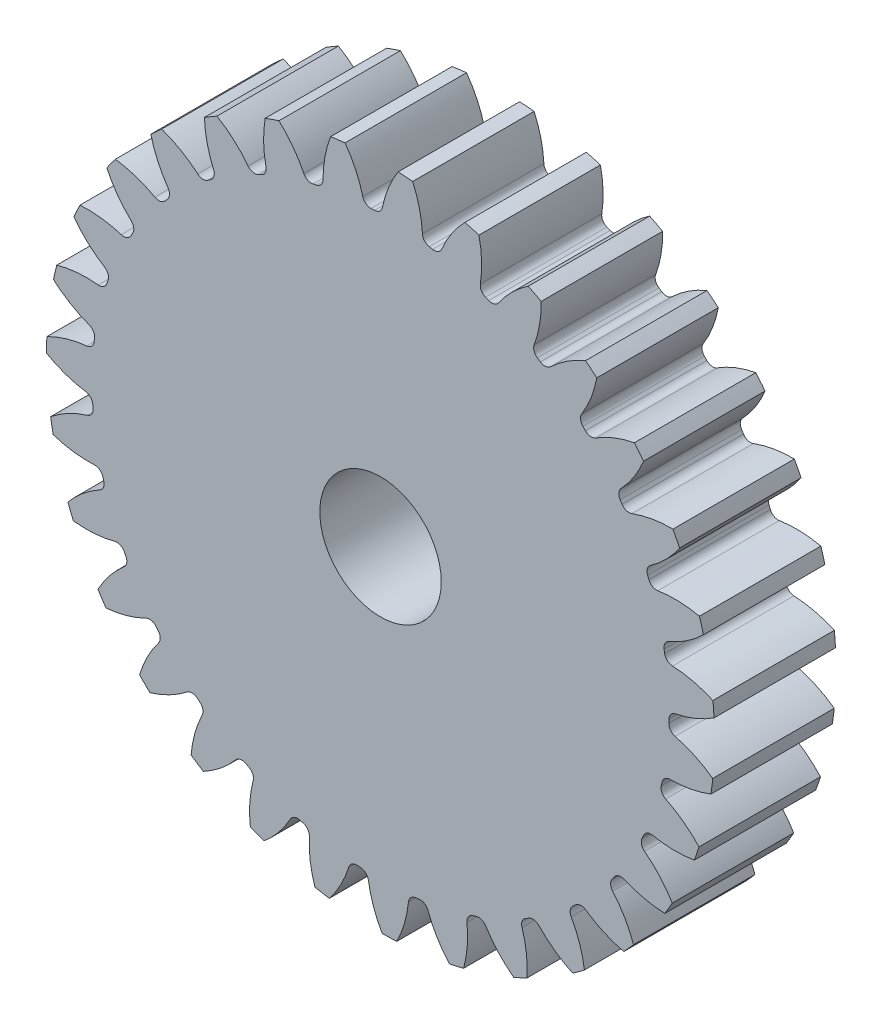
from build123d import *

# Parameters (mm, degrees)
SKETCH3_R         = 279.4
GEARBODY_DEPTH    = 101.6
TOOTHCUT_DEPTH    = 408.984411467
CIRPATTERN1_COUNT = 31
BOREDIA_R         = 50.8
BORE_DEPTH        = 12700


with BuildPart() as part:
    # Sketch3 → gearBody (new body)
    with BuildSketch(Plane.XY):
        Circle(SKETCH3_R)
    extrude(amount=GEARBODY_DEPTH)

    # Sketch2 → toothCut (cut, through all)
    with BuildSketch(Plane.XY):
        with BuildLine():
            ThreePointArc((241.19169685, -7.228787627), (241.231345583, -5.755684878), (241.261997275, -4.282367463))
            ThreePointArc((241.261997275, -4.282367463), (242.850603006, -0.001865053), (246.766285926, 2.34628237))
            ThreePointArc((246.766285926, 2.34628237), (263.721695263, 7.53666667), (279.4, 15.820189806))
            ThreePointArc((279.4, 15.820189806), (279.767905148, -6.675152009), (278.327569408, -29.127349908))
            ThreePointArc((278.327569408, -29.127349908), (263.06216353, -20.105522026), (246.373588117, -14.112405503))
            ThreePointArc((246.373588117, -14.112405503), (242.574348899, -11.580183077), (241.19169685, -7.228787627))
        make_face()
    toothcut = extrude(amount=TOOTHCUT_DEPTH, mode=Mode.SUBTRACT)

    # CirPattern1: toothCut ×31 about axis
    cirpattern1_axis = Axis((0, 0, 0), (0, 0, 1))
    for i in range(1, CIRPATTERN1_COUNT):
        add(toothcut.rotate(cirpattern1_axis, i * 360 / CIRPATTERN1_COUNT), mode=Mode.SUBTRACT)

    # boreDia → bore (cut, symmetric)
    with BuildSketch(Plane.XY):
        Circle(BOREDIA_R)
    extrude(amount=BORE_DEPTH, both=True, mode=Mode.SUBTRACT)


solid = part.part
